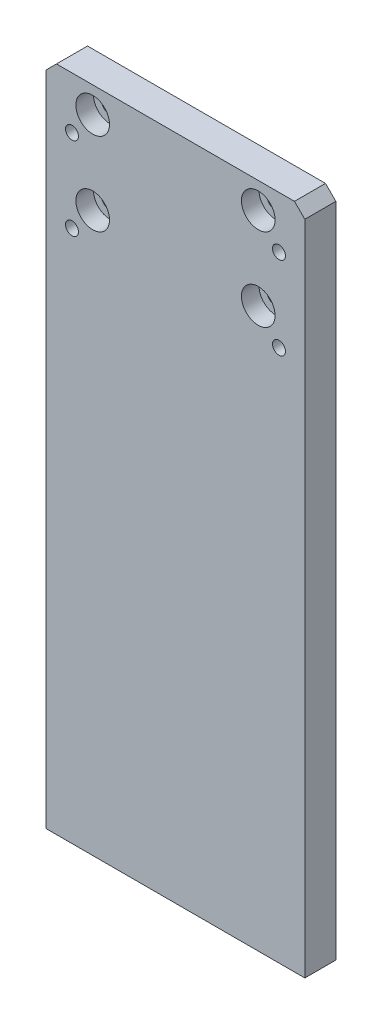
ISO-10303-21;
HEADER;
FILE_DESCRIPTION(('STEP AP214'),'2;1');
FILE_NAME('part.step','',(''),(''),'','','');
FILE_SCHEMA(('AUTOMOTIVE_DESIGN { 1 0 10303 214 1 1 1 1 }'));
ENDSEC;
DATA;
#1=APPLICATION_CONTEXT('core data for automotive mechanical design processes');
#2=APPLICATION_PROTOCOL_DEFINITION('international standard','automotive_design',2000,#1);
#3=PRODUCT_CONTEXT('',#1,'mechanical');
#4=PRODUCT('Part','Part','',(#3));
#5=PRODUCT_RELATED_PRODUCT_CATEGORY('part','',(#4));
#6=PRODUCT_DEFINITION_FORMATION('','',#4);
#7=PRODUCT_DEFINITION_CONTEXT('part definition',#1,'design');
#8=PRODUCT_DEFINITION('design','',#6,#7);
#9=PRODUCT_DEFINITION_SHAPE('','',#8);
#10=(LENGTH_UNIT() NAMED_UNIT(*) SI_UNIT(.MILLI.,.METRE.));
#11=(NAMED_UNIT(*) PLANE_ANGLE_UNIT() SI_UNIT($,.RADIAN.));
#12=(NAMED_UNIT(*) SI_UNIT($,.STERADIAN.) SOLID_ANGLE_UNIT());
#13=UNCERTAINTY_MEASURE_WITH_UNIT(LENGTH_MEASURE(1.E-05),#10,'distance_accuracy_value','');
#14=(GEOMETRIC_REPRESENTATION_CONTEXT(3) GLOBAL_UNCERTAINTY_ASSIGNED_CONTEXT((#13)) GLOBAL_UNIT_ASSIGNED_CONTEXT((#10,
#11,#12)) REPRESENTATION_CONTEXT('',''));
#15=CARTESIAN_POINT('',(0.,0.,0.));
#16=DIRECTION('',(0.,0.,1.));
#17=DIRECTION('',(1.,0.,0.));
#18=AXIS2_PLACEMENT_3D('',#15,#16,#17);
#19=CARTESIAN_POINT('',(25.,129.,3.));
#20=DIRECTION('',(-1.,0.,0.));
#21=DIRECTION('',(0.,-1.,0.));
#22=AXIS2_PLACEMENT_3D('',#19,#20,#21);
#23=PLANE('',#22);
#24=DIRECTION('',(0.,1.,0.));
#25=VECTOR('',#24,1.);
#26=CARTESIAN_POINT('',(25.,129.,-3.));
#27=LINE('',#26,#25);
#28=CARTESIAN_POINT('',(25.,0.,-3.));
#29=VERTEX_POINT('',#28);
#30=CARTESIAN_POINT('',(25.,127.,-3.));
#31=VERTEX_POINT('',#30);
#32=EDGE_CURVE('E187',#29,#31,#27,.T.);
#33=ORIENTED_EDGE('',*,*,#32,.T.);
#34=DIRECTION('',(0.,0.,1.));
#35=VECTOR('',#34,1.);
#36=CARTESIAN_POINT('',(25.,127.,3.));
#37=LINE('',#36,#35);
#38=CARTESIAN_POINT('',(25.,127.,3.));
#39=VERTEX_POINT('',#38);
#40=EDGE_CURVE('E11',#31,#39,#37,.T.);
#41=ORIENTED_EDGE('',*,*,#40,.T.);
#42=DIRECTION('',(0.,1.,0.));
#43=VECTOR('',#42,1.);
#44=CARTESIAN_POINT('',(25.,129.,3.));
#45=LINE('',#44,#43);
#46=CARTESIAN_POINT('',(25.,0.,3.));
#47=VERTEX_POINT('',#46);
#48=EDGE_CURVE('E188',#47,#39,#45,.T.);
#49=ORIENTED_EDGE('',*,*,#48,.F.);
#50=DIRECTION('',(0.,0.,-1.));
#51=VECTOR('',#50,1.);
#52=CARTESIAN_POINT('',(25.,0.,3.));
#53=LINE('',#52,#51);
#54=EDGE_CURVE('E197',#47,#29,#53,.T.);
#55=ORIENTED_EDGE('',*,*,#54,.T.);
#56=EDGE_LOOP('',(#33,#41,#49,#55));
#57=FACE_BOUND('',#56,.T.);
#58=ADVANCED_FACE('F39',(#57),#23,.F.);
#59=CARTESIAN_POINT('',(-25.,129.,3.));
#60=DIRECTION('',(0.,-1.,0.));
#61=DIRECTION('',(0.,0.,-1.));
#62=AXIS2_PLACEMENT_3D('',#59,#60,#61);
#63=PLANE('',#62);
#64=DIRECTION('',(-1.,0.,0.));
#65=VECTOR('',#64,1.);
#66=CARTESIAN_POINT('',(-25.,129.,-3.));
#67=LINE('',#66,#65);
#68=CARTESIAN_POINT('',(22.9999999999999,129.,-3.));
#69=VERTEX_POINT('',#68);
#70=CARTESIAN_POINT('',(-23.0000000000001,129.,-3.));
#71=VERTEX_POINT('',#70);
#72=EDGE_CURVE('E199',#69,#71,#67,.T.);
#73=ORIENTED_EDGE('',*,*,#72,.T.);
#74=DIRECTION('',(0.,0.,1.));
#75=VECTOR('',#74,1.);
#76=CARTESIAN_POINT('',(-23.0000000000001,129.,3.));
#77=LINE('',#76,#75);
#78=CARTESIAN_POINT('',(-23.0000000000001,129.,3.));
#79=VERTEX_POINT('',#78);
#80=EDGE_CURVE('E60',#71,#79,#77,.T.);
#81=ORIENTED_EDGE('',*,*,#80,.T.);
#82=DIRECTION('',(-1.,0.,0.));
#83=VECTOR('',#82,1.);
#84=CARTESIAN_POINT('',(-25.,129.,3.));
#85=LINE('',#84,#83);
#86=CARTESIAN_POINT('',(22.9999999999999,129.,3.));
#87=VERTEX_POINT('',#86);
#88=EDGE_CURVE('E190',#87,#79,#85,.T.);
#89=ORIENTED_EDGE('',*,*,#88,.F.);
#90=DIRECTION('',(0.,0.,-1.));
#91=VECTOR('',#90,1.);
#92=CARTESIAN_POINT('',(22.9999999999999,129.,3.));
#93=LINE('',#92,#91);
#94=EDGE_CURVE('E220',#87,#69,#93,.T.);
#95=ORIENTED_EDGE('',*,*,#94,.T.);
#96=EDGE_LOOP('',(#73,#81,#89,#95));
#97=FACE_BOUND('',#96,.T.);
#98=ADVANCED_FACE('F241',(#97),#63,.F.);
#99=CARTESIAN_POINT('',(-25.,129.,3.));
#100=DIRECTION('',(1.,0.,0.));
#101=DIRECTION('',(0.,1.,0.));
#102=AXIS2_PLACEMENT_3D('',#99,#100,#101);
#103=PLANE('',#102);
#104=DIRECTION('',(0.,-1.,0.));
#105=VECTOR('',#104,1.);
#106=CARTESIAN_POINT('',(-25.,129.,3.));
#107=LINE('',#106,#105);
#108=CARTESIAN_POINT('',(-25.,127.,3.));
#109=VERTEX_POINT('',#108);
#110=CARTESIAN_POINT('',(-25.,0.,3.));
#111=VERTEX_POINT('',#110);
#112=EDGE_CURVE('E193',#109,#111,#107,.T.);
#113=ORIENTED_EDGE('',*,*,#112,.F.);
#114=DIRECTION('',(0.,0.,-1.));
#115=VECTOR('',#114,1.);
#116=CARTESIAN_POINT('',(-25.,127.,3.));
#117=LINE('',#116,#115);
#118=CARTESIAN_POINT('',(-25.,127.,-3.));
#119=VERTEX_POINT('',#118);
#120=EDGE_CURVE('E209',#109,#119,#117,.T.);
#121=ORIENTED_EDGE('',*,*,#120,.T.);
#122=DIRECTION('',(0.,-1.,0.));
#123=VECTOR('',#122,1.);
#124=CARTESIAN_POINT('',(-25.,129.,-3.));
#125=LINE('',#124,#123);
#126=CARTESIAN_POINT('',(-25.,0.,-3.));
#127=VERTEX_POINT('',#126);
#128=EDGE_CURVE('E201',#119,#127,#125,.T.);
#129=ORIENTED_EDGE('',*,*,#128,.T.);
#130=DIRECTION('',(0.,0.,-1.));
#131=VECTOR('',#130,1.);
#132=CARTESIAN_POINT('',(-25.,0.,3.));
#133=LINE('',#132,#131);
#134=EDGE_CURVE('E206',#111,#127,#133,.T.);
#135=ORIENTED_EDGE('',*,*,#134,.F.);
#136=EDGE_LOOP('',(#113,#121,#129,#135));
#137=FACE_BOUND('',#136,.T.);
#138=ADVANCED_FACE('F233',(#137),#103,.F.);
#139=CARTESIAN_POINT('',(-25.,0.,3.));
#140=DIRECTION('',(0.,1.,0.));
#141=DIRECTION('',(0.,0.,1.));
#142=AXIS2_PLACEMENT_3D('',#139,#140,#141);
#143=PLANE('',#142);
#144=CARTESIAN_POINT('',(20.,0.,0.));
#145=DIRECTION('',(0.,-1.,0.));
#146=DIRECTION('',(0.,0.,-1.));
#147=AXIS2_PLACEMENT_3D('',#144,#145,#146);
#148=CIRCLE('',#147,1.65);
#149=CARTESIAN_POINT('',(20.,0.,-1.65));
#150=VERTEX_POINT('',#149);
#151=EDGE_CURVE('E109',#150,#150,#148,.T.);
#152=ORIENTED_EDGE('',*,*,#151,.F.);
#153=EDGE_LOOP('',(#152));
#154=FACE_BOUND('',#153,.T.);
#155=CARTESIAN_POINT('',(-20.,0.,0.));
#156=DIRECTION('',(0.,-1.,0.));
#157=DIRECTION('',(0.,0.,-1.));
#158=AXIS2_PLACEMENT_3D('',#155,#156,#157);
#159=CIRCLE('',#158,1.65);
#160=CARTESIAN_POINT('',(-20.,0.,-1.65));
#161=VERTEX_POINT('',#160);
#162=EDGE_CURVE('E108',#161,#161,#159,.T.);
#163=ORIENTED_EDGE('',*,*,#162,.F.);
#164=EDGE_LOOP('',(#163));
#165=FACE_BOUND('',#164,.T.);
#166=DIRECTION('',(1.,0.,0.));
#167=VECTOR('',#166,1.);
#168=CARTESIAN_POINT('',(-25.,0.,-3.));
#169=LINE('',#168,#167);
#170=EDGE_CURVE('E191',#127,#29,#169,.T.);
#171=ORIENTED_EDGE('',*,*,#170,.T.);
#172=ORIENTED_EDGE('',*,*,#54,.F.);
#173=DIRECTION('',(1.,0.,0.));
#174=VECTOR('',#173,1.);
#175=CARTESIAN_POINT('',(-25.,0.,3.));
#176=LINE('',#175,#174);
#177=EDGE_CURVE('E195',#111,#47,#176,.T.);
#178=ORIENTED_EDGE('',*,*,#177,.F.);
#179=ORIENTED_EDGE('',*,*,#134,.T.);
#180=EDGE_LOOP('',(#171,#172,#178,#179));
#181=FACE_BOUND('',#180,.T.);
#182=ADVANCED_FACE('F248',(#154,#165,#181),#143,.F.);
#183=CARTESIAN_POINT('',(0.,0.,3.));
#184=DIRECTION('',(0.,0.,1.));
#185=DIRECTION('',(1.,0.,0.));
#186=AXIS2_PLACEMENT_3D('',#183,#184,#185);
#187=PLANE('',#186);
#188=CARTESIAN_POINT('',(-20.,119.,3.));
#189=DIRECTION('',(0.,0.,1.));
#190=DIRECTION('',(1.,0.,0.));
#191=AXIS2_PLACEMENT_3D('',#188,#189,#190);
#192=CIRCLE('',#191,1.24999999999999);
#193=CARTESIAN_POINT('',(-18.75,119.,3.));
#194=VERTEX_POINT('',#193);
#195=EDGE_CURVE('E139',#194,#194,#192,.T.);
#196=ORIENTED_EDGE('',*,*,#195,.F.);
#197=EDGE_LOOP('',(#196));
#198=FACE_BOUND('',#197,.T.);
#199=CARTESIAN_POINT('',(20.,119.,3.));
#200=DIRECTION('',(0.,0.,1.));
#201=DIRECTION('',(1.,0.,0.));
#202=AXIS2_PLACEMENT_3D('',#199,#200,#201);
#203=CIRCLE('',#202,1.24999999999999);
#204=CARTESIAN_POINT('',(21.25,119.,3.));
#205=VERTEX_POINT('',#204);
#206=EDGE_CURVE('E145',#205,#205,#203,.T.);
#207=ORIENTED_EDGE('',*,*,#206,.F.);
#208=EDGE_LOOP('',(#207));
#209=FACE_BOUND('',#208,.T.);
#210=CARTESIAN_POINT('',(-20.,103.,3.));
#211=DIRECTION('',(0.,0.,1.));
#212=DIRECTION('',(1.,0.,0.));
#213=AXIS2_PLACEMENT_3D('',#210,#211,#212);
#214=CIRCLE('',#213,1.24999999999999);
#215=CARTESIAN_POINT('',(-18.75,103.,3.));
#216=VERTEX_POINT('',#215);
#217=EDGE_CURVE('E151',#216,#216,#214,.T.);
#218=ORIENTED_EDGE('',*,*,#217,.F.);
#219=EDGE_LOOP('',(#218));
#220=FACE_BOUND('',#219,.T.);
#221=CARTESIAN_POINT('',(20.,103.,3.));
#222=DIRECTION('',(0.,0.,1.));
#223=DIRECTION('',(1.,0.,0.));
#224=AXIS2_PLACEMENT_3D('',#221,#222,#223);
#225=CIRCLE('',#224,1.24999999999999);
#226=CARTESIAN_POINT('',(21.25,103.,3.));
#227=VERTEX_POINT('',#226);
#228=EDGE_CURVE('E157',#227,#227,#225,.T.);
#229=ORIENTED_EDGE('',*,*,#228,.F.);
#230=EDGE_LOOP('',(#229));
#231=FACE_BOUND('',#230,.T.);
#232=CARTESIAN_POINT('',(-16.0000000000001,108.,3.));
#233=DIRECTION('',(0.,0.,1.));
#234=DIRECTION('',(1.,0.,0.));
#235=AXIS2_PLACEMENT_3D('',#232,#233,#234);
#236=CIRCLE('',#235,3.25);
#237=CARTESIAN_POINT('',(-12.7500000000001,108.,3.));
#238=VERTEX_POINT('',#237);
#239=EDGE_CURVE('E163',#238,#238,#236,.T.);
#240=ORIENTED_EDGE('',*,*,#239,.F.);
#241=EDGE_LOOP('',(#240));
#242=FACE_BOUND('',#241,.T.);
#243=CARTESIAN_POINT('',(15.9999999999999,124.,3.));
#244=DIRECTION('',(0.,0.,1.));
#245=DIRECTION('',(1.,0.,0.));
#246=AXIS2_PLACEMENT_3D('',#243,#244,#245);
#247=CIRCLE('',#246,3.25);
#248=CARTESIAN_POINT('',(19.2499999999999,124.,3.));
#249=VERTEX_POINT('',#248);
#250=EDGE_CURVE('E169',#249,#249,#247,.T.);
#251=ORIENTED_EDGE('',*,*,#250,.F.);
#252=EDGE_LOOP('',(#251));
#253=FACE_BOUND('',#252,.T.);
#254=CARTESIAN_POINT('',(15.9999999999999,108.,3.));
#255=DIRECTION('',(0.,0.,1.));
#256=DIRECTION('',(1.,0.,0.));
#257=AXIS2_PLACEMENT_3D('',#254,#255,#256);
#258=CIRCLE('',#257,3.25);
#259=CARTESIAN_POINT('',(19.2499999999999,108.,3.));
#260=VERTEX_POINT('',#259);
#261=EDGE_CURVE('E175',#260,#260,#258,.T.);
#262=ORIENTED_EDGE('',*,*,#261,.F.);
#263=EDGE_LOOP('',(#262));
#264=FACE_BOUND('',#263,.T.);
#265=CARTESIAN_POINT('',(-16.0000000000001,124.,3.));
#266=DIRECTION('',(0.,0.,1.));
#267=DIRECTION('',(1.,0.,0.));
#268=AXIS2_PLACEMENT_3D('',#265,#266,#267);
#269=CIRCLE('',#268,3.25);
#270=CARTESIAN_POINT('',(-12.7500000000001,124.,3.));
#271=VERTEX_POINT('',#270);
#272=EDGE_CURVE('E181',#271,#271,#269,.T.);
#273=ORIENTED_EDGE('',*,*,#272,.F.);
#274=EDGE_LOOP('',(#273));
#275=FACE_BOUND('',#274,.T.);
#276=ORIENTED_EDGE('',*,*,#88,.T.);
#277=DIRECTION('',(0.70710678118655,0.707106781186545,0.));
#278=VECTOR('',#277,1.);
#279=CARTESIAN_POINT('',(-75.9999999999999,76.0000000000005,3.));
#280=LINE('',#279,#278);
#281=EDGE_CURVE('E47',#79,#109,#280,.F.);
#282=ORIENTED_EDGE('',*,*,#281,.T.);
#283=ORIENTED_EDGE('',*,*,#112,.T.);
#284=ORIENTED_EDGE('',*,*,#177,.T.);
#285=ORIENTED_EDGE('',*,*,#48,.T.);
#286=DIRECTION('',(0.707106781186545,-0.70710678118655,0.));
#287=VECTOR('',#286,1.);
#288=CARTESIAN_POINT('',(76.,75.9999999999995,3.));
#289=LINE('',#288,#287);
#290=EDGE_CURVE('E224',#39,#87,#289,.F.);
#291=ORIENTED_EDGE('',*,*,#290,.T.);
#292=EDGE_LOOP('',(#276,#282,#283,#284,#285,#291));
#293=FACE_BOUND('',#292,.T.);
#294=ADVANCED_FACE('F228',(#198,#209,#220,#231,#242,#253,#264,#275,#293),#187,.T.);
#295=CARTESIAN_POINT('',(0.,0.,-3.));
#296=DIRECTION('',(0.,0.,1.));
#297=DIRECTION('',(1.,0.,0.));
#298=AXIS2_PLACEMENT_3D('',#295,#296,#297);
#299=PLANE('',#298);
#300=CARTESIAN_POINT('',(-16.0000000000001,124.,-3.00000000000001));
#301=DIRECTION('',(0.,0.,1.));
#302=DIRECTION('',(1.,0.,0.));
#303=AXIS2_PLACEMENT_3D('',#300,#301,#302);
#304=CIRCLE('',#303,1.75000000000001);
#305=CARTESIAN_POINT('',(-14.25,124.,-3.00000000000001));
#306=VERTEX_POINT('',#305);
#307=EDGE_CURVE('E119',#306,#306,#304,.T.);
#308=ORIENTED_EDGE('',*,*,#307,.T.);
#309=EDGE_LOOP('',(#308));
#310=FACE_BOUND('',#309,.T.);
#311=CARTESIAN_POINT('',(15.9999999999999,108.,-3.00000000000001));
#312=DIRECTION('',(0.,0.,1.));
#313=DIRECTION('',(1.,0.,0.));
#314=AXIS2_PLACEMENT_3D('',#311,#312,#313);
#315=CIRCLE('',#314,1.75000000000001);
#316=CARTESIAN_POINT('',(17.75,108.,-3.00000000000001));
#317=VERTEX_POINT('',#316);
#318=EDGE_CURVE('E123',#317,#317,#315,.T.);
#319=ORIENTED_EDGE('',*,*,#318,.T.);
#320=EDGE_LOOP('',(#319));
#321=FACE_BOUND('',#320,.T.);
#322=CARTESIAN_POINT('',(15.9999999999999,124.,-3.00000000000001));
#323=DIRECTION('',(0.,0.,1.));
#324=DIRECTION('',(1.,0.,0.));
#325=AXIS2_PLACEMENT_3D('',#322,#323,#324);
#326=CIRCLE('',#325,1.75000000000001);
#327=CARTESIAN_POINT('',(17.75,124.,-3.00000000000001));
#328=VERTEX_POINT('',#327);
#329=EDGE_CURVE('E129',#328,#328,#326,.T.);
#330=ORIENTED_EDGE('',*,*,#329,.T.);
#331=EDGE_LOOP('',(#330));
#332=FACE_BOUND('',#331,.T.);
#333=CARTESIAN_POINT('',(-16.0000000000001,108.,-3.00000000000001));
#334=DIRECTION('',(0.,0.,1.));
#335=DIRECTION('',(1.,0.,0.));
#336=AXIS2_PLACEMENT_3D('',#333,#334,#335);
#337=CIRCLE('',#336,1.75000000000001);
#338=CARTESIAN_POINT('',(-14.25,108.,-3.00000000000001));
#339=VERTEX_POINT('',#338);
#340=EDGE_CURVE('E135',#339,#339,#337,.T.);
#341=ORIENTED_EDGE('',*,*,#340,.T.);
#342=EDGE_LOOP('',(#341));
#343=FACE_BOUND('',#342,.T.);
#344=CARTESIAN_POINT('',(-20.,119.,-3.));
#345=DIRECTION('',(0.,0.,1.));
#346=DIRECTION('',(1.,0.,0.));
#347=AXIS2_PLACEMENT_3D('',#344,#345,#346);
#348=CIRCLE('',#347,1.24999999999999);
#349=CARTESIAN_POINT('',(-18.75,119.,-3.));
#350=VERTEX_POINT('',#349);
#351=EDGE_CURVE('E142',#350,#350,#348,.T.);
#352=ORIENTED_EDGE('',*,*,#351,.T.);
#353=EDGE_LOOP('',(#352));
#354=FACE_BOUND('',#353,.T.);
#355=CARTESIAN_POINT('',(20.,119.,-3.));
#356=DIRECTION('',(0.,0.,1.));
#357=DIRECTION('',(1.,0.,0.));
#358=AXIS2_PLACEMENT_3D('',#355,#356,#357);
#359=CIRCLE('',#358,1.24999999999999);
#360=CARTESIAN_POINT('',(21.25,119.,-3.));
#361=VERTEX_POINT('',#360);
#362=EDGE_CURVE('E148',#361,#361,#359,.T.);
#363=ORIENTED_EDGE('',*,*,#362,.T.);
#364=EDGE_LOOP('',(#363));
#365=FACE_BOUND('',#364,.T.);
#366=CARTESIAN_POINT('',(-20.,103.,-3.));
#367=DIRECTION('',(0.,0.,1.));
#368=DIRECTION('',(1.,0.,0.));
#369=AXIS2_PLACEMENT_3D('',#366,#367,#368);
#370=CIRCLE('',#369,1.24999999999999);
#371=CARTESIAN_POINT('',(-18.75,103.,-3.));
#372=VERTEX_POINT('',#371);
#373=EDGE_CURVE('E154',#372,#372,#370,.T.);
#374=ORIENTED_EDGE('',*,*,#373,.T.);
#375=EDGE_LOOP('',(#374));
#376=FACE_BOUND('',#375,.T.);
#377=CARTESIAN_POINT('',(20.,103.,-3.));
#378=DIRECTION('',(0.,0.,1.));
#379=DIRECTION('',(1.,0.,0.));
#380=AXIS2_PLACEMENT_3D('',#377,#378,#379);
#381=CIRCLE('',#380,1.24999999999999);
#382=CARTESIAN_POINT('',(21.25,103.,-3.));
#383=VERTEX_POINT('',#382);
#384=EDGE_CURVE('E160',#383,#383,#381,.T.);
#385=ORIENTED_EDGE('',*,*,#384,.T.);
#386=EDGE_LOOP('',(#385));
#387=FACE_BOUND('',#386,.T.);
#388=ORIENTED_EDGE('',*,*,#128,.F.);
#389=DIRECTION('',(-0.70710678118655,-0.707106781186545,0.));
#390=VECTOR('',#389,1.);
#391=CARTESIAN_POINT('',(-25.,127.,-3.));
#392=LINE('',#391,#390);
#393=EDGE_CURVE('E218',#119,#71,#392,.F.);
#394=ORIENTED_EDGE('',*,*,#393,.T.);
#395=ORIENTED_EDGE('',*,*,#72,.F.);
#396=DIRECTION('',(-0.707106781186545,0.70710678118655,0.));
#397=VECTOR('',#396,1.);
#398=CARTESIAN_POINT('',(22.9999999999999,129.,-3.));
#399=LINE('',#398,#397);
#400=EDGE_CURVE('E216',#69,#31,#399,.F.);
#401=ORIENTED_EDGE('',*,*,#400,.T.);
#402=ORIENTED_EDGE('',*,*,#32,.F.);
#403=ORIENTED_EDGE('',*,*,#170,.F.);
#404=EDGE_LOOP('',(#388,#394,#395,#401,#402,#403));
#405=FACE_BOUND('',#404,.T.);
#406=ADVANCED_FACE('F239',(#310,#321,#332,#343,#354,#365,#376,#387,#405),#299,.F.);
#407=CARTESIAN_POINT('',(-14.3000000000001,124.,-0.399999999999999));
#408=DIRECTION('',(0.,0.,-1.));
#409=DIRECTION('',(-1.,0.,0.));
#410=AXIS2_PLACEMENT_3D('',#407,#408,#409);
#411=PLANE('',#410);
#412=CARTESIAN_POINT('',(-16.0000000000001,124.,-0.399999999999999));
#413=DIRECTION('',(0.,0.,-1.));
#414=DIRECTION('',(-1.,0.,0.));
#415=AXIS2_PLACEMENT_3D('',#412,#413,#414);
#416=CIRCLE('',#415,1.75000000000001);
#417=CARTESIAN_POINT('',(-17.7500000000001,124.,-0.399999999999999));
#418=VERTEX_POINT('',#417);
#419=EDGE_CURVE('E122',#418,#418,#416,.T.);
#420=ORIENTED_EDGE('',*,*,#419,.T.);
#421=EDGE_LOOP('',(#420));
#422=FACE_BOUND('',#421,.T.);
#423=CARTESIAN_POINT('',(-16.0000000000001,124.,-0.399999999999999));
#424=DIRECTION('',(0.,0.,1.));
#425=DIRECTION('',(1.,0.,0.));
#426=AXIS2_PLACEMENT_3D('',#423,#424,#425);
#427=CIRCLE('',#426,3.25);
#428=CARTESIAN_POINT('',(-12.7500000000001,124.,-0.399999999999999));
#429=VERTEX_POINT('',#428);
#430=EDGE_CURVE('E184',#429,#429,#427,.T.);
#431=ORIENTED_EDGE('',*,*,#430,.T.);
#432=EDGE_LOOP('',(#431));
#433=FACE_BOUND('',#432,.T.);
#434=ADVANCED_FACE('F344',(#422,#433),#411,.F.);
#435=CARTESIAN_POINT('',(-16.0000000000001,124.,3.));
#436=DIRECTION('',(0.,0.,1.));
#437=DIRECTION('',(1.,0.,0.));
#438=AXIS2_PLACEMENT_3D('',#435,#436,#437);
#439=CYLINDRICAL_SURFACE('',#438,3.25);
#440=ORIENTED_EDGE('',*,*,#430,.F.);
#441=EDGE_LOOP('',(#440));
#442=FACE_BOUND('',#441,.T.);
#443=ORIENTED_EDGE('',*,*,#272,.T.);
#444=EDGE_LOOP('',(#443));
#445=FACE_BOUND('',#444,.T.);
#446=ADVANCED_FACE('F340',(#442,#445),#439,.F.);
#447=CARTESIAN_POINT('',(17.6999999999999,108.,-0.399999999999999));
#448=DIRECTION('',(0.,0.,-1.));
#449=DIRECTION('',(-1.,0.,0.));
#450=AXIS2_PLACEMENT_3D('',#447,#448,#449);
#451=PLANE('',#450);
#452=CARTESIAN_POINT('',(15.9999999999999,108.,-0.399999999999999));
#453=DIRECTION('',(0.,0.,-1.));
#454=DIRECTION('',(-1.,0.,0.));
#455=AXIS2_PLACEMENT_3D('',#452,#453,#454);
#456=CIRCLE('',#455,1.75000000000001);
#457=CARTESIAN_POINT('',(14.2499999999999,108.,-0.399999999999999));
#458=VERTEX_POINT('',#457);
#459=EDGE_CURVE('E126',#458,#458,#456,.T.);
#460=ORIENTED_EDGE('',*,*,#459,.T.);
#461=EDGE_LOOP('',(#460));
#462=FACE_BOUND('',#461,.T.);
#463=CARTESIAN_POINT('',(15.9999999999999,108.,-0.399999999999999));
#464=DIRECTION('',(0.,0.,1.));
#465=DIRECTION('',(1.,0.,0.));
#466=AXIS2_PLACEMENT_3D('',#463,#464,#465);
#467=CIRCLE('',#466,3.25);
#468=CARTESIAN_POINT('',(19.2499999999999,108.,-0.399999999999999));
#469=VERTEX_POINT('',#468);
#470=EDGE_CURVE('E178',#469,#469,#467,.T.);
#471=ORIENTED_EDGE('',*,*,#470,.T.);
#472=EDGE_LOOP('',(#471));
#473=FACE_BOUND('',#472,.T.);
#474=ADVANCED_FACE('F336',(#462,#473),#451,.F.);
#475=CARTESIAN_POINT('',(15.9999999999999,108.,3.));
#476=DIRECTION('',(0.,0.,1.));
#477=DIRECTION('',(1.,0.,0.));
#478=AXIS2_PLACEMENT_3D('',#475,#476,#477);
#479=CYLINDRICAL_SURFACE('',#478,3.25);
#480=ORIENTED_EDGE('',*,*,#470,.F.);
#481=EDGE_LOOP('',(#480));
#482=FACE_BOUND('',#481,.T.);
#483=ORIENTED_EDGE('',*,*,#261,.T.);
#484=EDGE_LOOP('',(#483));
#485=FACE_BOUND('',#484,.T.);
#486=ADVANCED_FACE('F332',(#482,#485),#479,.F.);
#487=CARTESIAN_POINT('',(17.6999999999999,124.,-0.399999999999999));
#488=DIRECTION('',(0.,0.,-1.));
#489=DIRECTION('',(-1.,0.,0.));
#490=AXIS2_PLACEMENT_3D('',#487,#488,#489);
#491=PLANE('',#490);
#492=CARTESIAN_POINT('',(15.9999999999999,124.,-0.399999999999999));
#493=DIRECTION('',(0.,0.,-1.));
#494=DIRECTION('',(-1.,0.,0.));
#495=AXIS2_PLACEMENT_3D('',#492,#493,#494);
#496=CIRCLE('',#495,1.75000000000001);
#497=CARTESIAN_POINT('',(14.2499999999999,124.,-0.399999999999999));
#498=VERTEX_POINT('',#497);
#499=EDGE_CURVE('E132',#498,#498,#496,.T.);
#500=ORIENTED_EDGE('',*,*,#499,.T.);
#501=EDGE_LOOP('',(#500));
#502=FACE_BOUND('',#501,.T.);
#503=CARTESIAN_POINT('',(15.9999999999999,124.,-0.399999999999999));
#504=DIRECTION('',(0.,0.,1.));
#505=DIRECTION('',(1.,0.,0.));
#506=AXIS2_PLACEMENT_3D('',#503,#504,#505);
#507=CIRCLE('',#506,3.25);
#508=CARTESIAN_POINT('',(19.2499999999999,124.,-0.399999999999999));
#509=VERTEX_POINT('',#508);
#510=EDGE_CURVE('E172',#509,#509,#507,.T.);
#511=ORIENTED_EDGE('',*,*,#510,.T.);
#512=EDGE_LOOP('',(#511));
#513=FACE_BOUND('',#512,.T.);
#514=ADVANCED_FACE('F328',(#502,#513),#491,.F.);
#515=CARTESIAN_POINT('',(15.9999999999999,124.,3.));
#516=DIRECTION('',(0.,0.,1.));
#517=DIRECTION('',(1.,0.,0.));
#518=AXIS2_PLACEMENT_3D('',#515,#516,#517);
#519=CYLINDRICAL_SURFACE('',#518,3.25);
#520=ORIENTED_EDGE('',*,*,#510,.F.);
#521=EDGE_LOOP('',(#520));
#522=FACE_BOUND('',#521,.T.);
#523=ORIENTED_EDGE('',*,*,#250,.T.);
#524=EDGE_LOOP('',(#523));
#525=FACE_BOUND('',#524,.T.);
#526=ADVANCED_FACE('F324',(#522,#525),#519,.F.);
#527=CARTESIAN_POINT('',(-14.3000000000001,108.,-0.399999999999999));
#528=DIRECTION('',(0.,0.,-1.));
#529=DIRECTION('',(-1.,0.,0.));
#530=AXIS2_PLACEMENT_3D('',#527,#528,#529);
#531=PLANE('',#530);
#532=CARTESIAN_POINT('',(-16.0000000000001,108.,-0.399999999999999));
#533=DIRECTION('',(0.,0.,-1.));
#534=DIRECTION('',(-1.,0.,0.));
#535=AXIS2_PLACEMENT_3D('',#532,#533,#534);
#536=CIRCLE('',#535,1.75000000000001);
#537=CARTESIAN_POINT('',(-17.7500000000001,108.,-0.399999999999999));
#538=VERTEX_POINT('',#537);
#539=EDGE_CURVE('E138',#538,#538,#536,.T.);
#540=ORIENTED_EDGE('',*,*,#539,.T.);
#541=EDGE_LOOP('',(#540));
#542=FACE_BOUND('',#541,.T.);
#543=CARTESIAN_POINT('',(-16.0000000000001,108.,-0.399999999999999));
#544=DIRECTION('',(0.,0.,1.));
#545=DIRECTION('',(1.,0.,0.));
#546=AXIS2_PLACEMENT_3D('',#543,#544,#545);
#547=CIRCLE('',#546,3.25);
#548=CARTESIAN_POINT('',(-12.7500000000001,108.,-0.399999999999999));
#549=VERTEX_POINT('',#548);
#550=EDGE_CURVE('E166',#549,#549,#547,.T.);
#551=ORIENTED_EDGE('',*,*,#550,.T.);
#552=EDGE_LOOP('',(#551));
#553=FACE_BOUND('',#552,.T.);
#554=ADVANCED_FACE('F320',(#542,#553),#531,.F.);
#555=CARTESIAN_POINT('',(-16.0000000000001,108.,3.));
#556=DIRECTION('',(0.,0.,1.));
#557=DIRECTION('',(1.,0.,0.));
#558=AXIS2_PLACEMENT_3D('',#555,#556,#557);
#559=CYLINDRICAL_SURFACE('',#558,3.25);
#560=ORIENTED_EDGE('',*,*,#550,.F.);
#561=EDGE_LOOP('',(#560));
#562=FACE_BOUND('',#561,.T.);
#563=ORIENTED_EDGE('',*,*,#239,.T.);
#564=EDGE_LOOP('',(#563));
#565=FACE_BOUND('',#564,.T.);
#566=ADVANCED_FACE('F316',(#562,#565),#559,.F.);
#567=CARTESIAN_POINT('',(20.,103.,3.));
#568=DIRECTION('',(0.,0.,1.));
#569=DIRECTION('',(1.,0.,0.));
#570=AXIS2_PLACEMENT_3D('',#567,#568,#569);
#571=CYLINDRICAL_SURFACE('',#570,1.24999999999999);
#572=ORIENTED_EDGE('',*,*,#384,.F.);
#573=EDGE_LOOP('',(#572));
#574=FACE_BOUND('',#573,.T.);
#575=ORIENTED_EDGE('',*,*,#228,.T.);
#576=EDGE_LOOP('',(#575));
#577=FACE_BOUND('',#576,.T.);
#578=ADVANCED_FACE('F312',(#574,#577),#571,.F.);
#579=CARTESIAN_POINT('',(-20.,103.,3.));
#580=DIRECTION('',(0.,0.,1.));
#581=DIRECTION('',(1.,0.,0.));
#582=AXIS2_PLACEMENT_3D('',#579,#580,#581);
#583=CYLINDRICAL_SURFACE('',#582,1.24999999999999);
#584=ORIENTED_EDGE('',*,*,#373,.F.);
#585=EDGE_LOOP('',(#584));
#586=FACE_BOUND('',#585,.T.);
#587=ORIENTED_EDGE('',*,*,#217,.T.);
#588=EDGE_LOOP('',(#587));
#589=FACE_BOUND('',#588,.T.);
#590=ADVANCED_FACE('F308',(#586,#589),#583,.F.);
#591=CARTESIAN_POINT('',(20.,119.,3.));
#592=DIRECTION('',(0.,0.,1.));
#593=DIRECTION('',(1.,0.,0.));
#594=AXIS2_PLACEMENT_3D('',#591,#592,#593);
#595=CYLINDRICAL_SURFACE('',#594,1.24999999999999);
#596=ORIENTED_EDGE('',*,*,#362,.F.);
#597=EDGE_LOOP('',(#596));
#598=FACE_BOUND('',#597,.T.);
#599=ORIENTED_EDGE('',*,*,#206,.T.);
#600=EDGE_LOOP('',(#599));
#601=FACE_BOUND('',#600,.T.);
#602=ADVANCED_FACE('F304',(#598,#601),#595,.F.);
#603=CARTESIAN_POINT('',(-20.,119.,3.));
#604=DIRECTION('',(0.,0.,1.));
#605=DIRECTION('',(1.,0.,0.));
#606=AXIS2_PLACEMENT_3D('',#603,#604,#605);
#607=CYLINDRICAL_SURFACE('',#606,1.24999999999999);
#608=ORIENTED_EDGE('',*,*,#351,.F.);
#609=EDGE_LOOP('',(#608));
#610=FACE_BOUND('',#609,.T.);
#611=ORIENTED_EDGE('',*,*,#195,.T.);
#612=EDGE_LOOP('',(#611));
#613=FACE_BOUND('',#612,.T.);
#614=ADVANCED_FACE('F300',(#610,#613),#607,.F.);
#615=CARTESIAN_POINT('',(-16.0000000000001,108.,3.));
#616=DIRECTION('',(0.,0.,1.));
#617=DIRECTION('',(1.,0.,0.));
#618=AXIS2_PLACEMENT_3D('',#615,#616,#617);
#619=CYLINDRICAL_SURFACE('',#618,1.75000000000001);
#620=ORIENTED_EDGE('',*,*,#340,.F.);
#621=EDGE_LOOP('',(#620));
#622=FACE_BOUND('',#621,.T.);
#623=ORIENTED_EDGE('',*,*,#539,.F.);
#624=EDGE_LOOP('',(#623));
#625=FACE_BOUND('',#624,.T.);
#626=ADVANCED_FACE('F296',(#622,#625),#619,.F.);
#627=CARTESIAN_POINT('',(15.9999999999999,124.,3.));
#628=DIRECTION('',(0.,0.,1.));
#629=DIRECTION('',(1.,0.,0.));
#630=AXIS2_PLACEMENT_3D('',#627,#628,#629);
#631=CYLINDRICAL_SURFACE('',#630,1.75000000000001);
#632=ORIENTED_EDGE('',*,*,#329,.F.);
#633=EDGE_LOOP('',(#632));
#634=FACE_BOUND('',#633,.T.);
#635=ORIENTED_EDGE('',*,*,#499,.F.);
#636=EDGE_LOOP('',(#635));
#637=FACE_BOUND('',#636,.T.);
#638=ADVANCED_FACE('F292',(#634,#637),#631,.F.);
#639=CARTESIAN_POINT('',(15.9999999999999,108.,3.));
#640=DIRECTION('',(0.,0.,1.));
#641=DIRECTION('',(1.,0.,0.));
#642=AXIS2_PLACEMENT_3D('',#639,#640,#641);
#643=CYLINDRICAL_SURFACE('',#642,1.75000000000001);
#644=ORIENTED_EDGE('',*,*,#318,.F.);
#645=EDGE_LOOP('',(#644));
#646=FACE_BOUND('',#645,.T.);
#647=ORIENTED_EDGE('',*,*,#459,.F.);
#648=EDGE_LOOP('',(#647));
#649=FACE_BOUND('',#648,.T.);
#650=ADVANCED_FACE('F288',(#646,#649),#643,.F.);
#651=CARTESIAN_POINT('',(-16.0000000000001,124.,3.));
#652=DIRECTION('',(0.,0.,1.));
#653=DIRECTION('',(1.,0.,0.));
#654=AXIS2_PLACEMENT_3D('',#651,#652,#653);
#655=CYLINDRICAL_SURFACE('',#654,1.75000000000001);
#656=ORIENTED_EDGE('',*,*,#307,.F.);
#657=EDGE_LOOP('',(#656));
#658=FACE_BOUND('',#657,.T.);
#659=ORIENTED_EDGE('',*,*,#419,.F.);
#660=EDGE_LOOP('',(#659));
#661=FACE_BOUND('',#660,.T.);
#662=ADVANCED_FACE('F284',(#658,#661),#655,.F.);
#663=CARTESIAN_POINT('',(-20.,11.5,0.));
#664=DIRECTION('',(0.,-1.,0.));
#665=DIRECTION('',(0.,0.,-1.));
#666=AXIS2_PLACEMENT_3D('',#663,#664,#665);
#667=CONICAL_SURFACE('',#666,1.65,1.02974425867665);
#668=CARTESIAN_POINT('',(-20.,12.4914200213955,0.));
#669=VERTEX_POINT('',#668);
#670=VERTEX_LOOP('',#669);
#671=FACE_BOUND('',#670,.T.);
#672=CARTESIAN_POINT('',(-20.,11.5,0.));
#673=DIRECTION('',(0.,-1.,0.));
#674=DIRECTION('',(0.,0.,-1.));
#675=AXIS2_PLACEMENT_3D('',#672,#673,#674);
#676=CIRCLE('',#675,1.65);
#677=CARTESIAN_POINT('',(-20.,11.5,-1.65));
#678=VERTEX_POINT('',#677);
#679=EDGE_CURVE('E112',#678,#678,#676,.T.);
#680=ORIENTED_EDGE('',*,*,#679,.T.);
#681=EDGE_LOOP('',(#680));
#682=FACE_BOUND('',#681,.T.);
#683=ADVANCED_FACE('F280',(#671,#682),#667,.F.);
#684=CARTESIAN_POINT('',(-20.,0.,0.));
#685=DIRECTION('',(0.,-1.,0.));
#686=DIRECTION('',(0.,0.,-1.));
#687=AXIS2_PLACEMENT_3D('',#684,#685,#686);
#688=CYLINDRICAL_SURFACE('',#687,1.65);
#689=ORIENTED_EDGE('',*,*,#679,.F.);
#690=EDGE_LOOP('',(#689));
#691=FACE_BOUND('',#690,.T.);
#692=ORIENTED_EDGE('',*,*,#162,.T.);
#693=EDGE_LOOP('',(#692));
#694=FACE_BOUND('',#693,.T.);
#695=ADVANCED_FACE('F102',(#691,#694),#688,.F.);
#696=CARTESIAN_POINT('',(20.,11.5,0.));
#697=DIRECTION('',(0.,-1.,0.));
#698=DIRECTION('',(0.,0.,-1.));
#699=AXIS2_PLACEMENT_3D('',#696,#697,#698);
#700=CONICAL_SURFACE('',#699,1.65,1.02974425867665);
#701=CARTESIAN_POINT('',(20.,12.4914200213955,0.));
#702=VERTEX_POINT('',#701);
#703=VERTEX_LOOP('',#702);
#704=FACE_BOUND('',#703,.T.);
#705=CARTESIAN_POINT('',(20.,11.5,0.));
#706=DIRECTION('',(0.,-1.,0.));
#707=DIRECTION('',(0.,0.,-1.));
#708=AXIS2_PLACEMENT_3D('',#705,#706,#707);
#709=CIRCLE('',#708,1.65);
#710=CARTESIAN_POINT('',(20.,11.5,-1.65));
#711=VERTEX_POINT('',#710);
#712=EDGE_CURVE('E106',#711,#711,#709,.T.);
#713=ORIENTED_EDGE('',*,*,#712,.T.);
#714=EDGE_LOOP('',(#713));
#715=FACE_BOUND('',#714,.T.);
#716=ADVANCED_FACE('F98',(#704,#715),#700,.F.);
#717=CARTESIAN_POINT('',(20.,0.,0.));
#718=DIRECTION('',(0.,-1.,0.));
#719=DIRECTION('',(0.,0.,-1.));
#720=AXIS2_PLACEMENT_3D('',#717,#718,#719);
#721=CYLINDRICAL_SURFACE('',#720,1.65);
#722=ORIENTED_EDGE('',*,*,#712,.F.);
#723=EDGE_LOOP('',(#722));
#724=FACE_BOUND('',#723,.T.);
#725=ORIENTED_EDGE('',*,*,#151,.T.);
#726=EDGE_LOOP('',(#725));
#727=FACE_BOUND('',#726,.T.);
#728=ADVANCED_FACE('F101',(#724,#727),#721,.F.);
#729=CARTESIAN_POINT('',(-25.,127.,3.));
#730=DIRECTION('',(0.707106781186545,-0.70710678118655,0.));
#731=DIRECTION('',(0.,0.,-1.));
#732=AXIS2_PLACEMENT_3D('',#729,#730,#731);
#733=PLANE('',#732);
#734=ORIENTED_EDGE('',*,*,#281,.F.);
#735=ORIENTED_EDGE('',*,*,#80,.F.);
#736=ORIENTED_EDGE('',*,*,#393,.F.);
#737=ORIENTED_EDGE('',*,*,#120,.F.);
#738=EDGE_LOOP('',(#734,#735,#736,#737));
#739=FACE_BOUND('',#738,.T.);
#740=ADVANCED_FACE('F236',(#739),#733,.F.);
#741=CARTESIAN_POINT('',(22.9999999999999,129.,3.));
#742=DIRECTION('',(-0.70710678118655,-0.707106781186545,0.));
#743=DIRECTION('',(0.,0.,-1.));
#744=AXIS2_PLACEMENT_3D('',#741,#742,#743);
#745=PLANE('',#744);
#746=ORIENTED_EDGE('',*,*,#290,.F.);
#747=ORIENTED_EDGE('',*,*,#40,.F.);
#748=ORIENTED_EDGE('',*,*,#400,.F.);
#749=ORIENTED_EDGE('',*,*,#94,.F.);
#750=EDGE_LOOP('',(#746,#747,#748,#749));
#751=FACE_BOUND('',#750,.T.);
#752=ADVANCED_FACE('F41',(#751),#745,.F.);
#753=CLOSED_SHELL('',(#58,#98,#138,#182,#294,#406,#434,#446,#474,#486,#514,#526,#554,#566,#578,
#590,#602,#614,#626,#638,#650,#662,#683,#695,#716,#728,#740,#752));
#754=MANIFOLD_SOLID_BREP('B2',#753);
#755=ADVANCED_BREP_SHAPE_REPRESENTATION('',(#18,#754),#14);
#756=SHAPE_DEFINITION_REPRESENTATION(#9,#755);
ENDSEC;
END-ISO-10303-21;
